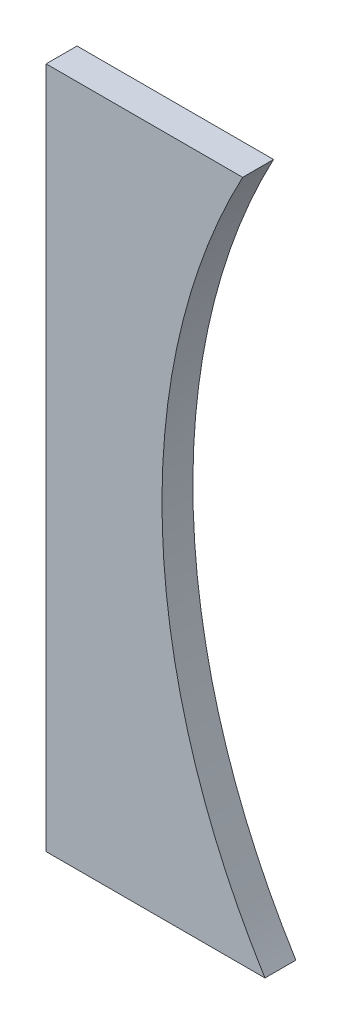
ISO-10303-21;
HEADER;
FILE_DESCRIPTION(('STEP AP214'),'2;1');
FILE_NAME('part.step','',(''),(''),'','','');
FILE_SCHEMA(('AUTOMOTIVE_DESIGN { 1 0 10303 214 1 1 1 1 }'));
ENDSEC;
DATA;
#1=APPLICATION_CONTEXT('core data for automotive mechanical design processes');
#2=APPLICATION_PROTOCOL_DEFINITION('international standard','automotive_design',2000,#1);
#3=PRODUCT_CONTEXT('',#1,'mechanical');
#4=PRODUCT('Part','Part','',(#3));
#5=PRODUCT_RELATED_PRODUCT_CATEGORY('part','',(#4));
#6=PRODUCT_DEFINITION_FORMATION('','',#4);
#7=PRODUCT_DEFINITION_CONTEXT('part definition',#1,'design');
#8=PRODUCT_DEFINITION('design','',#6,#7);
#9=PRODUCT_DEFINITION_SHAPE('','',#8);
#10=(LENGTH_UNIT() NAMED_UNIT(*) SI_UNIT(.MILLI.,.METRE.));
#11=(NAMED_UNIT(*) PLANE_ANGLE_UNIT() SI_UNIT($,.RADIAN.));
#12=(NAMED_UNIT(*) SI_UNIT($,.STERADIAN.) SOLID_ANGLE_UNIT());
#13=UNCERTAINTY_MEASURE_WITH_UNIT(LENGTH_MEASURE(1.E-05),#10,'distance_accuracy_value','');
#14=(GEOMETRIC_REPRESENTATION_CONTEXT(3) GLOBAL_UNCERTAINTY_ASSIGNED_CONTEXT((#13)) GLOBAL_UNIT_ASSIGNED_CONTEXT((#10,
#11,#12)) REPRESENTATION_CONTEXT('',''));
#15=CARTESIAN_POINT('',(0.,0.,0.));
#16=DIRECTION('',(0.,0.,1.));
#17=DIRECTION('',(1.,0.,0.));
#18=AXIS2_PLACEMENT_3D('',#15,#16,#17);
#19=CARTESIAN_POINT('',(225.,140.,12.));
#20=DIRECTION('',(0.,0.,-1.));
#21=DIRECTION('',(-1.,0.,0.));
#22=AXIS2_PLACEMENT_3D('',#19,#20,#21);
#23=CYLINDRICAL_SURFACE('',#22,265.);
#24=CARTESIAN_POINT('',(225.,140.,0.));
#25=DIRECTION('',(0.,0.,-1.));
#26=DIRECTION('',(1.,0.,0.));
#27=AXIS2_PLACEMENT_3D('',#24,#25,#26);
#28=CIRCLE('',#27,265.);
#29=CARTESIAN_POINT('',(0.,0.,0.));
#30=VERTEX_POINT('',#29);
#31=CARTESIAN_POINT('',(-8.66642891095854,265.,0.));
#32=VERTEX_POINT('',#31);
#33=EDGE_CURVE('E74',#30,#32,#28,.T.);
#34=ORIENTED_EDGE('',*,*,#33,.T.);
#35=DIRECTION('',(0.,0.,-1.));
#36=VECTOR('',#35,1.);
#37=CARTESIAN_POINT('',(-8.66642891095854,265.,12.));
#38=LINE('',#37,#36);
#39=CARTESIAN_POINT('',(-8.66642891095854,265.,12.));
#40=VERTEX_POINT('',#39);
#41=EDGE_CURVE('E11',#40,#32,#38,.T.);
#42=ORIENTED_EDGE('',*,*,#41,.F.);
#43=CARTESIAN_POINT('',(225.,140.,12.));
#44=DIRECTION('',(0.,0.,-1.));
#45=DIRECTION('',(1.,0.,0.));
#46=AXIS2_PLACEMENT_3D('',#43,#44,#45);
#47=CIRCLE('',#46,265.);
#48=CARTESIAN_POINT('',(0.,0.,12.));
#49=VERTEX_POINT('',#48);
#50=EDGE_CURVE('E92',#49,#40,#47,.T.);
#51=ORIENTED_EDGE('',*,*,#50,.F.);
#52=DIRECTION('',(0.,0.,-1.));
#53=VECTOR('',#52,1.);
#54=CARTESIAN_POINT('',(0.,0.,12.));
#55=LINE('',#54,#53);
#56=EDGE_CURVE('E86',#49,#30,#55,.T.);
#57=ORIENTED_EDGE('',*,*,#56,.T.);
#58=EDGE_LOOP('',(#34,#42,#51,#57));
#59=FACE_BOUND('',#58,.T.);
#60=ADVANCED_FACE('F30',(#59),#23,.F.);
#61=CARTESIAN_POINT('',(-85.,265.,12.));
#62=DIRECTION('',(0.,-1.,0.));
#63=DIRECTION('',(1.,0.,0.));
#64=AXIS2_PLACEMENT_3D('',#61,#62,#63);
#65=PLANE('',#64);
#66=DIRECTION('',(-1.,0.,0.));
#67=VECTOR('',#66,1.);
#68=CARTESIAN_POINT('',(-85.,265.,0.));
#69=LINE('',#68,#67);
#70=CARTESIAN_POINT('',(-85.,265.,0.));
#71=VERTEX_POINT('',#70);
#72=EDGE_CURVE('E70',#32,#71,#69,.T.);
#73=ORIENTED_EDGE('',*,*,#72,.T.);
#74=DIRECTION('',(0.,0.,-1.));
#75=VECTOR('',#74,1.);
#76=CARTESIAN_POINT('',(-85.,265.,12.));
#77=LINE('',#76,#75);
#78=CARTESIAN_POINT('',(-85.,265.,12.));
#79=VERTEX_POINT('',#78);
#80=EDGE_CURVE('E37',#79,#71,#77,.T.);
#81=ORIENTED_EDGE('',*,*,#80,.F.);
#82=DIRECTION('',(-1.,0.,0.));
#83=VECTOR('',#82,1.);
#84=CARTESIAN_POINT('',(-85.,265.,12.));
#85=LINE('',#84,#83);
#86=EDGE_CURVE('E82',#40,#79,#85,.T.);
#87=ORIENTED_EDGE('',*,*,#86,.F.);
#88=ORIENTED_EDGE('',*,*,#41,.T.);
#89=EDGE_LOOP('',(#73,#81,#87,#88));
#90=FACE_BOUND('',#89,.T.);
#91=ADVANCED_FACE('F81',(#90),#65,.F.);
#92=CARTESIAN_POINT('',(-85.,0.,12.));
#93=DIRECTION('',(1.,0.,0.));
#94=DIRECTION('',(0.,0.,-1.));
#95=AXIS2_PLACEMENT_3D('',#92,#93,#94);
#96=PLANE('',#95);
#97=DIRECTION('',(0.,-1.,0.));
#98=VECTOR('',#97,1.);
#99=CARTESIAN_POINT('',(-85.,0.,0.));
#100=LINE('',#99,#98);
#101=CARTESIAN_POINT('',(-85.,0.,0.));
#102=VERTEX_POINT('',#101);
#103=EDGE_CURVE('E75',#71,#102,#100,.T.);
#104=ORIENTED_EDGE('',*,*,#103,.T.);
#105=DIRECTION('',(0.,0.,-1.));
#106=VECTOR('',#105,1.);
#107=CARTESIAN_POINT('',(-85.,0.,12.));
#108=LINE('',#107,#106);
#109=CARTESIAN_POINT('',(-85.,0.,12.));
#110=VERTEX_POINT('',#109);
#111=EDGE_CURVE('E98',#110,#102,#108,.T.);
#112=ORIENTED_EDGE('',*,*,#111,.F.);
#113=DIRECTION('',(0.,-1.,0.));
#114=VECTOR('',#113,1.);
#115=CARTESIAN_POINT('',(-85.,0.,12.));
#116=LINE('',#115,#114);
#117=EDGE_CURVE('E49',#79,#110,#116,.T.);
#118=ORIENTED_EDGE('',*,*,#117,.F.);
#119=ORIENTED_EDGE('',*,*,#80,.T.);
#120=EDGE_LOOP('',(#104,#112,#118,#119));
#121=FACE_BOUND('',#120,.T.);
#122=ADVANCED_FACE('F101',(#121),#96,.F.);
#123=CARTESIAN_POINT('',(0.,0.,12.));
#124=DIRECTION('',(0.,1.,0.));
#125=DIRECTION('',(-1.,0.,0.));
#126=AXIS2_PLACEMENT_3D('',#123,#124,#125);
#127=PLANE('',#126);
#128=DIRECTION('',(1.,0.,0.));
#129=VECTOR('',#128,1.);
#130=CARTESIAN_POINT('',(0.,0.,0.));
#131=LINE('',#130,#129);
#132=EDGE_CURVE('E90',#102,#30,#131,.T.);
#133=ORIENTED_EDGE('',*,*,#132,.T.);
#134=ORIENTED_EDGE('',*,*,#56,.F.);
#135=DIRECTION('',(1.,0.,0.));
#136=VECTOR('',#135,1.);
#137=CARTESIAN_POINT('',(0.,0.,12.));
#138=LINE('',#137,#136);
#139=EDGE_CURVE('E44',#110,#49,#138,.T.);
#140=ORIENTED_EDGE('',*,*,#139,.F.);
#141=ORIENTED_EDGE('',*,*,#111,.T.);
#142=EDGE_LOOP('',(#133,#134,#140,#141));
#143=FACE_BOUND('',#142,.T.);
#144=ADVANCED_FACE('F103',(#143),#127,.F.);
#145=CARTESIAN_POINT('',(225.,140.,12.));
#146=DIRECTION('',(0.,0.,1.));
#147=DIRECTION('',(1.,0.,0.));
#148=AXIS2_PLACEMENT_3D('',#145,#146,#147);
#149=PLANE('',#148);
#150=ORIENTED_EDGE('',*,*,#50,.T.);
#151=ORIENTED_EDGE('',*,*,#86,.T.);
#152=ORIENTED_EDGE('',*,*,#117,.T.);
#153=ORIENTED_EDGE('',*,*,#139,.T.);
#154=EDGE_LOOP('',(#150,#151,#152,#153));
#155=FACE_BOUND('',#154,.T.);
#156=ADVANCED_FACE('F104',(#155),#149,.T.);
#157=CARTESIAN_POINT('',(225.,140.,0.));
#158=DIRECTION('',(0.,0.,1.));
#159=DIRECTION('',(1.,0.,0.));
#160=AXIS2_PLACEMENT_3D('',#157,#158,#159);
#161=PLANE('',#160);
#162=ORIENTED_EDGE('',*,*,#33,.F.);
#163=ORIENTED_EDGE('',*,*,#132,.F.);
#164=ORIENTED_EDGE('',*,*,#103,.F.);
#165=ORIENTED_EDGE('',*,*,#72,.F.);
#166=EDGE_LOOP('',(#162,#163,#164,#165));
#167=FACE_BOUND('',#166,.T.);
#168=ADVANCED_FACE('F71',(#167),#161,.F.);
#169=CLOSED_SHELL('',(#60,#91,#122,#144,#156,#168));
#170=MANIFOLD_SOLID_BREP('B2',#169);
#171=ADVANCED_BREP_SHAPE_REPRESENTATION('',(#18,#170),#14);
#172=SHAPE_DEFINITION_REPRESENTATION(#9,#171);
ENDSEC;
END-ISO-10303-21;
